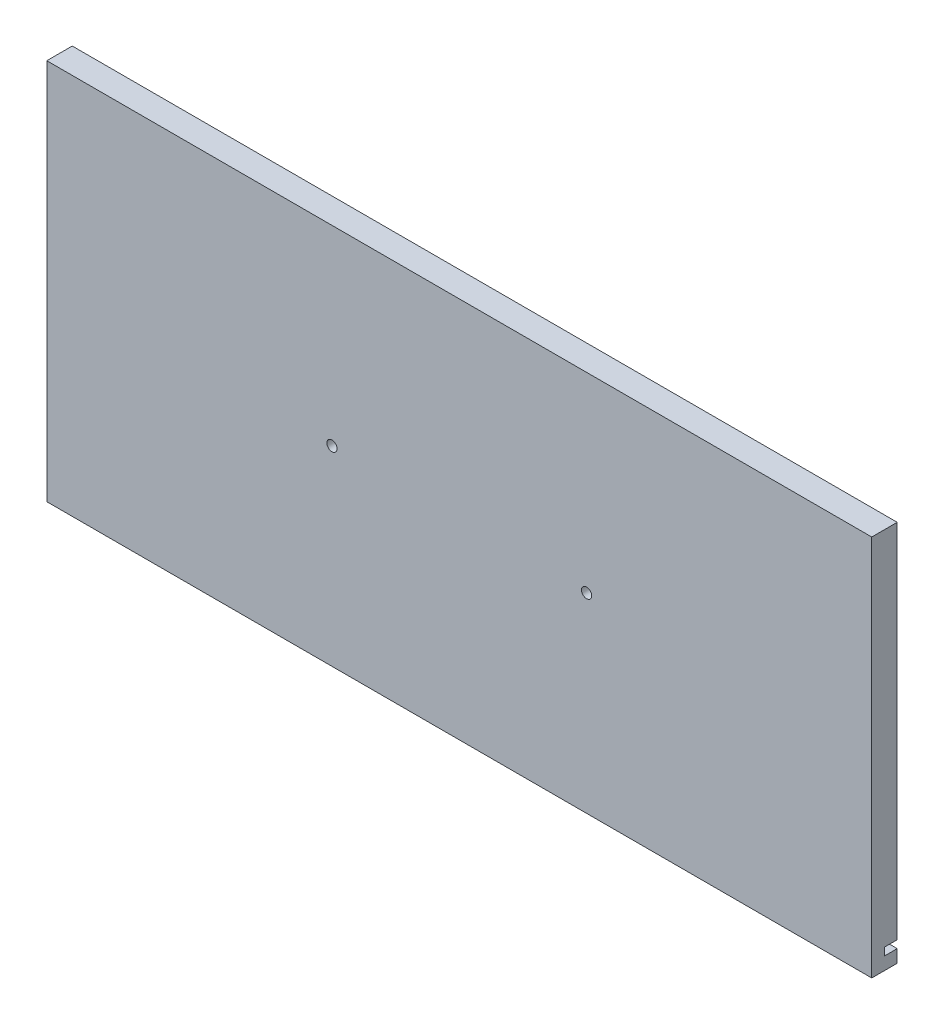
ISO-10303-21;
HEADER;
FILE_DESCRIPTION(('STEP AP214'),'2;1');
FILE_NAME('part.step','',(''),(''),'','','');
FILE_SCHEMA(('AUTOMOTIVE_DESIGN { 1 0 10303 214 1 1 1 1 }'));
ENDSEC;
DATA;
#1=APPLICATION_CONTEXT('core data for automotive mechanical design processes');
#2=APPLICATION_PROTOCOL_DEFINITION('international standard','automotive_design',2000,#1);
#3=PRODUCT_CONTEXT('',#1,'mechanical');
#4=PRODUCT('Part','Part','',(#3));
#5=PRODUCT_RELATED_PRODUCT_CATEGORY('part','',(#4));
#6=PRODUCT_DEFINITION_FORMATION('','',#4);
#7=PRODUCT_DEFINITION_CONTEXT('part definition',#1,'design');
#8=PRODUCT_DEFINITION('design','',#6,#7);
#9=PRODUCT_DEFINITION_SHAPE('','',#8);
#10=(LENGTH_UNIT() NAMED_UNIT(*) SI_UNIT(.MILLI.,.METRE.));
#11=(NAMED_UNIT(*) PLANE_ANGLE_UNIT() SI_UNIT($,.RADIAN.));
#12=(NAMED_UNIT(*) SI_UNIT($,.STERADIAN.) SOLID_ANGLE_UNIT());
#13=UNCERTAINTY_MEASURE_WITH_UNIT(LENGTH_MEASURE(1.E-05),#10,'distance_accuracy_value','');
#14=(GEOMETRIC_REPRESENTATION_CONTEXT(3) GLOBAL_UNCERTAINTY_ASSIGNED_CONTEXT((#13)) GLOBAL_UNIT_ASSIGNED_CONTEXT((#10,
#11,#12)) REPRESENTATION_CONTEXT('',''));
#15=CARTESIAN_POINT('',(0.,0.,0.));
#16=DIRECTION('',(0.,0.,1.));
#17=DIRECTION('',(1.,0.,0.));
#18=AXIS2_PLACEMENT_3D('',#15,#16,#17);
#19=CARTESIAN_POINT('',(162.,75.,0.));
#20=DIRECTION('',(0.,0.,-1.));
#21=DIRECTION('',(-1.,0.,0.));
#22=AXIS2_PLACEMENT_3D('',#19,#20,#21);
#23=PLANE('',#22);
#24=DIRECTION('',(-1.,0.,0.));
#25=VECTOR('',#24,1.);
#26=CARTESIAN_POINT('',(-162.,-70.,0.));
#27=LINE('',#26,#25);
#28=CARTESIAN_POINT('',(162.,-70.,0.));
#29=VERTEX_POINT('',#28);
#30=CARTESIAN_POINT('',(-162.,-70.,0.));
#31=VERTEX_POINT('',#30);
#32=EDGE_CURVE('E119',#29,#31,#27,.T.);
#33=ORIENTED_EDGE('',*,*,#32,.F.);
#34=DIRECTION('',(0.,1.,0.));
#35=VECTOR('',#34,1.);
#36=CARTESIAN_POINT('',(162.,-75.,0.));
#37=LINE('',#36,#35);
#38=CARTESIAN_POINT('',(162.,-75.,0.));
#39=VERTEX_POINT('',#38);
#40=EDGE_CURVE('E165',#39,#29,#37,.T.);
#41=ORIENTED_EDGE('',*,*,#40,.F.);
#42=DIRECTION('',(1.,0.,0.));
#43=VECTOR('',#42,1.);
#44=CARTESIAN_POINT('',(-162.,-75.,0.));
#45=LINE('',#44,#43);
#46=CARTESIAN_POINT('',(-162.,-75.,0.));
#47=VERTEX_POINT('',#46);
#48=EDGE_CURVE('E75',#47,#39,#45,.T.);
#49=ORIENTED_EDGE('',*,*,#48,.F.);
#50=DIRECTION('',(0.,-1.,0.));
#51=VECTOR('',#50,1.);
#52=CARTESIAN_POINT('',(-162.,-75.,0.));
#53=LINE('',#52,#51);
#54=EDGE_CURVE('E170',#31,#47,#53,.T.);
#55=ORIENTED_EDGE('',*,*,#54,.F.);
#56=EDGE_LOOP('',(#33,#41,#49,#55));
#57=FACE_BOUND('',#56,.T.);
#58=ADVANCED_FACE('F30',(#57),#23,.T.);
#59=CARTESIAN_POINT('',(162.,-75.,10.));
#60=DIRECTION('',(-1.,0.,0.));
#61=DIRECTION('',(0.,0.,1.));
#62=AXIS2_PLACEMENT_3D('',#59,#60,#61);
#63=PLANE('',#62);
#64=ORIENTED_EDGE('',*,*,#40,.T.);
#65=DIRECTION('',(0.,0.,-1.));
#66=VECTOR('',#65,1.);
#67=CARTESIAN_POINT('',(162.,-70.,5.));
#68=LINE('',#67,#66);
#69=CARTESIAN_POINT('',(162.,-70.,5.));
#70=VERTEX_POINT('',#69);
#71=EDGE_CURVE('E127',#70,#29,#68,.T.);
#72=ORIENTED_EDGE('',*,*,#71,.F.);
#73=DIRECTION('',(0.,-1.,0.));
#74=VECTOR('',#73,1.);
#75=CARTESIAN_POINT('',(162.,-67.,5.));
#76=LINE('',#75,#74);
#77=CARTESIAN_POINT('',(162.,-67.,5.));
#78=VERTEX_POINT('',#77);
#79=EDGE_CURVE('E109',#78,#70,#76,.T.);
#80=ORIENTED_EDGE('',*,*,#79,.F.);
#81=DIRECTION('',(0.,0.,-1.));
#82=VECTOR('',#81,1.);
#83=CARTESIAN_POINT('',(162.,-67.,5.));
#84=LINE('',#83,#82);
#85=CARTESIAN_POINT('',(162.,-67.,0.));
#86=VERTEX_POINT('',#85);
#87=EDGE_CURVE('E106',#78,#86,#84,.T.);
#88=ORIENTED_EDGE('',*,*,#87,.T.);
#89=CARTESIAN_POINT('',(162.,75.,0.));
#90=VERTEX_POINT('',#89);
#91=EDGE_CURVE('E155',#86,#90,#37,.T.);
#92=ORIENTED_EDGE('',*,*,#91,.T.);
#93=DIRECTION('',(0.,0.,-1.));
#94=VECTOR('',#93,1.);
#95=CARTESIAN_POINT('',(162.,75.,10.));
#96=LINE('',#95,#94);
#97=CARTESIAN_POINT('',(162.,75.,10.));
#98=VERTEX_POINT('',#97);
#99=EDGE_CURVE('E11',#98,#90,#96,.T.);
#100=ORIENTED_EDGE('',*,*,#99,.F.);
#101=DIRECTION('',(0.,1.,0.));
#102=VECTOR('',#101,1.);
#103=CARTESIAN_POINT('',(162.,-75.,10.));
#104=LINE('',#103,#102);
#105=CARTESIAN_POINT('',(162.,-75.,10.));
#106=VERTEX_POINT('',#105);
#107=EDGE_CURVE('E158',#106,#98,#104,.T.);
#108=ORIENTED_EDGE('',*,*,#107,.F.);
#109=DIRECTION('',(0.,0.,-1.));
#110=VECTOR('',#109,1.);
#111=CARTESIAN_POINT('',(162.,-75.,10.));
#112=LINE('',#111,#110);
#113=EDGE_CURVE('E164',#106,#39,#112,.T.);
#114=ORIENTED_EDGE('',*,*,#113,.T.);
#115=EDGE_LOOP('',(#64,#72,#80,#88,#92,#100,#108,#114));
#116=FACE_BOUND('',#115,.T.);
#117=ADVANCED_FACE('F32',(#116),#63,.F.);
#118=CARTESIAN_POINT('',(-162.,75.,10.));
#119=DIRECTION('',(0.,-1.,0.));
#120=DIRECTION('',(1.,0.,0.));
#121=AXIS2_PLACEMENT_3D('',#118,#119,#120);
#122=PLANE('',#121);
#123=DIRECTION('',(-1.,0.,0.));
#124=VECTOR('',#123,1.);
#125=CARTESIAN_POINT('',(-162.,75.,0.));
#126=LINE('',#125,#124);
#127=CARTESIAN_POINT('',(-162.,75.,0.));
#128=VERTEX_POINT('',#127);
#129=EDGE_CURVE('E168',#90,#128,#126,.T.);
#130=ORIENTED_EDGE('',*,*,#129,.T.);
#131=DIRECTION('',(0.,0.,-1.));
#132=VECTOR('',#131,1.);
#133=CARTESIAN_POINT('',(-162.,75.,10.));
#134=LINE('',#133,#132);
#135=CARTESIAN_POINT('',(-162.,75.,10.));
#136=VERTEX_POINT('',#135);
#137=EDGE_CURVE('E38',#136,#128,#134,.T.);
#138=ORIENTED_EDGE('',*,*,#137,.F.);
#139=DIRECTION('',(-1.,0.,0.));
#140=VECTOR('',#139,1.);
#141=CARTESIAN_POINT('',(-162.,75.,10.));
#142=LINE('',#141,#140);
#143=EDGE_CURVE('E82',#98,#136,#142,.T.);
#144=ORIENTED_EDGE('',*,*,#143,.F.);
#145=ORIENTED_EDGE('',*,*,#99,.T.);
#146=EDGE_LOOP('',(#130,#138,#144,#145));
#147=FACE_BOUND('',#146,.T.);
#148=ADVANCED_FACE('F211',(#147),#122,.F.);
#149=CARTESIAN_POINT('',(-162.,-75.,10.));
#150=DIRECTION('',(1.,0.,0.));
#151=DIRECTION('',(0.,0.,-1.));
#152=AXIS2_PLACEMENT_3D('',#149,#150,#151);
#153=PLANE('',#152);
#154=DIRECTION('',(0.,1.,0.));
#155=VECTOR('',#154,1.);
#156=CARTESIAN_POINT('',(-162.,-67.,5.));
#157=LINE('',#156,#155);
#158=CARTESIAN_POINT('',(-162.,-70.,5.));
#159=VERTEX_POINT('',#158);
#160=CARTESIAN_POINT('',(-162.,-67.,5.));
#161=VERTEX_POINT('',#160);
#162=EDGE_CURVE('E110',#159,#161,#157,.T.);
#163=ORIENTED_EDGE('',*,*,#162,.F.);
#164=DIRECTION('',(0.,0.,-1.));
#165=VECTOR('',#164,1.);
#166=CARTESIAN_POINT('',(-162.,-70.,5.));
#167=LINE('',#166,#165);
#168=EDGE_CURVE('E139',#159,#31,#167,.T.);
#169=ORIENTED_EDGE('',*,*,#168,.T.);
#170=ORIENTED_EDGE('',*,*,#54,.T.);
#171=DIRECTION('',(0.,0.,-1.));
#172=VECTOR('',#171,1.);
#173=CARTESIAN_POINT('',(-162.,-75.,10.));
#174=LINE('',#173,#172);
#175=CARTESIAN_POINT('',(-162.,-75.,10.));
#176=VERTEX_POINT('',#175);
#177=EDGE_CURVE('E174',#176,#47,#174,.T.);
#178=ORIENTED_EDGE('',*,*,#177,.F.);
#179=DIRECTION('',(0.,-1.,0.));
#180=VECTOR('',#179,1.);
#181=CARTESIAN_POINT('',(-162.,-75.,10.));
#182=LINE('',#181,#180);
#183=EDGE_CURVE('E161',#136,#176,#182,.T.);
#184=ORIENTED_EDGE('',*,*,#183,.F.);
#185=ORIENTED_EDGE('',*,*,#137,.T.);
#186=CARTESIAN_POINT('',(-162.,-67.,0.));
#187=VERTEX_POINT('',#186);
#188=EDGE_CURVE('E125',#128,#187,#53,.T.);
#189=ORIENTED_EDGE('',*,*,#188,.T.);
#190=DIRECTION('',(0.,0.,-1.));
#191=VECTOR('',#190,1.);
#192=CARTESIAN_POINT('',(-162.,-67.,5.));
#193=LINE('',#192,#191);
#194=EDGE_CURVE('E45',#161,#187,#193,.T.);
#195=ORIENTED_EDGE('',*,*,#194,.F.);
#196=EDGE_LOOP('',(#163,#169,#170,#178,#184,#185,#189,#195));
#197=FACE_BOUND('',#196,.T.);
#198=ADVANCED_FACE('F122',(#197),#153,.F.);
#199=CARTESIAN_POINT('',(-162.,-75.,10.));
#200=DIRECTION('',(0.,1.,0.));
#201=DIRECTION('',(0.,0.,1.));
#202=AXIS2_PLACEMENT_3D('',#199,#200,#201);
#203=PLANE('',#202);
#204=ORIENTED_EDGE('',*,*,#48,.T.);
#205=ORIENTED_EDGE('',*,*,#113,.F.);
#206=DIRECTION('',(1.,0.,0.));
#207=VECTOR('',#206,1.);
#208=CARTESIAN_POINT('',(-162.,-75.,10.));
#209=LINE('',#208,#207);
#210=EDGE_CURVE('E54',#176,#106,#209,.T.);
#211=ORIENTED_EDGE('',*,*,#210,.F.);
#212=ORIENTED_EDGE('',*,*,#177,.T.);
#213=EDGE_LOOP('',(#204,#205,#211,#212));
#214=FACE_BOUND('',#213,.T.);
#215=ADVANCED_FACE('F201',(#214),#203,.F.);
#216=CARTESIAN_POINT('',(162.,75.,10.));
#217=DIRECTION('',(0.,0.,-1.));
#218=DIRECTION('',(-1.,0.,0.));
#219=AXIS2_PLACEMENT_3D('',#216,#217,#218);
#220=PLANE('',#219);
#221=CARTESIAN_POINT('',(50.,0.,10.));
#222=DIRECTION('',(0.,0.,1.));
#223=DIRECTION('',(-1.,0.,0.));
#224=AXIS2_PLACEMENT_3D('',#221,#222,#223);
#225=CIRCLE('',#224,2.);
#226=CARTESIAN_POINT('',(48.,0.,10.));
#227=VERTEX_POINT('',#226);
#228=EDGE_CURVE('E284',#227,#227,#225,.T.);
#229=ORIENTED_EDGE('',*,*,#228,.F.);
#230=EDGE_LOOP('',(#229));
#231=FACE_BOUND('',#230,.T.);
#232=CARTESIAN_POINT('',(-50.,0.,10.));
#233=DIRECTION('',(0.,0.,1.));
#234=DIRECTION('',(1.,0.,0.));
#235=AXIS2_PLACEMENT_3D('',#232,#233,#234);
#236=CIRCLE('',#235,2.);
#237=CARTESIAN_POINT('',(-48.,0.,10.));
#238=VERTEX_POINT('',#237);
#239=EDGE_CURVE('E187',#238,#238,#236,.T.);
#240=ORIENTED_EDGE('',*,*,#239,.F.);
#241=EDGE_LOOP('',(#240));
#242=FACE_BOUND('',#241,.T.);
#243=ORIENTED_EDGE('',*,*,#107,.T.);
#244=ORIENTED_EDGE('',*,*,#143,.T.);
#245=ORIENTED_EDGE('',*,*,#183,.T.);
#246=ORIENTED_EDGE('',*,*,#210,.T.);
#247=EDGE_LOOP('',(#243,#244,#245,#246));
#248=FACE_BOUND('',#247,.T.);
#249=ADVANCED_FACE('F203',(#231,#242,#248),#220,.F.);
#250=DIRECTION('',(1.,0.,0.));
#251=VECTOR('',#250,1.);
#252=CARTESIAN_POINT('',(-162.,-67.,0.));
#253=LINE('',#252,#251);
#254=EDGE_CURVE('E182',#187,#86,#253,.T.);
#255=ORIENTED_EDGE('',*,*,#254,.F.);
#256=ORIENTED_EDGE('',*,*,#188,.F.);
#257=ORIENTED_EDGE('',*,*,#129,.F.);
#258=ORIENTED_EDGE('',*,*,#91,.F.);
#259=EDGE_LOOP('',(#255,#256,#257,#258));
#260=FACE_BOUND('',#259,.T.);
#261=CARTESIAN_POINT('',(130.5,-57.5,0.));
#262=DIRECTION('',(0.,0.,-1.));
#263=DIRECTION('',(1.,0.,0.));
#264=AXIS2_PLACEMENT_3D('',#261,#262,#263);
#265=CIRCLE('',#264,2.5);
#266=CARTESIAN_POINT('',(133.,-57.5,0.));
#267=VERTEX_POINT('',#266);
#268=EDGE_CURVE('E136',#267,#267,#265,.T.);
#269=ORIENTED_EDGE('',*,*,#268,.F.);
#270=EDGE_LOOP('',(#269));
#271=FACE_BOUND('',#270,.T.);
#272=CARTESIAN_POINT('',(-140.5,-57.5,0.));
#273=DIRECTION('',(0.,0.,-1.));
#274=DIRECTION('',(-1.,0.,0.));
#275=AXIS2_PLACEMENT_3D('',#272,#273,#274);
#276=CIRCLE('',#275,2.5);
#277=CARTESIAN_POINT('',(-143.,-57.5,0.));
#278=VERTEX_POINT('',#277);
#279=EDGE_CURVE('E135',#278,#278,#276,.T.);
#280=ORIENTED_EDGE('',*,*,#279,.F.);
#281=EDGE_LOOP('',(#280));
#282=FACE_BOUND('',#281,.T.);
#283=CARTESIAN_POINT('',(-140.5,17.5,0.));
#284=DIRECTION('',(0.,0.,-1.));
#285=DIRECTION('',(1.,0.,0.));
#286=AXIS2_PLACEMENT_3D('',#283,#284,#285);
#287=CIRCLE('',#286,2.5);
#288=CARTESIAN_POINT('',(-138.,17.5,0.));
#289=VERTEX_POINT('',#288);
#290=EDGE_CURVE('E143',#289,#289,#287,.T.);
#291=ORIENTED_EDGE('',*,*,#290,.F.);
#292=EDGE_LOOP('',(#291));
#293=FACE_BOUND('',#292,.T.);
#294=CARTESIAN_POINT('',(130.5,17.5,0.));
#295=DIRECTION('',(0.,0.,-1.));
#296=DIRECTION('',(-1.,0.,0.));
#297=AXIS2_PLACEMENT_3D('',#294,#295,#296);
#298=CIRCLE('',#297,2.5);
#299=CARTESIAN_POINT('',(128.,17.5,0.));
#300=VERTEX_POINT('',#299);
#301=EDGE_CURVE('E149',#300,#300,#298,.T.);
#302=ORIENTED_EDGE('',*,*,#301,.F.);
#303=EDGE_LOOP('',(#302));
#304=FACE_BOUND('',#303,.T.);
#305=ADVANCED_FACE('F179',(#260,#271,#282,#293,#304),#23,.T.);
#306=CARTESIAN_POINT('',(130.5,17.5,5.));
#307=DIRECTION('',(0.,0.,-1.));
#308=DIRECTION('',(-1.,0.,0.));
#309=AXIS2_PLACEMENT_3D('',#306,#307,#308);
#310=CYLINDRICAL_SURFACE('',#309,2.5);
#311=CARTESIAN_POINT('',(130.5,17.5,5.));
#312=DIRECTION('',(0.,0.,-1.));
#313=DIRECTION('',(-1.,0.,0.));
#314=AXIS2_PLACEMENT_3D('',#311,#312,#313);
#315=CIRCLE('',#314,2.5);
#316=CARTESIAN_POINT('',(128.,17.5,5.));
#317=VERTEX_POINT('',#316);
#318=EDGE_CURVE('E152',#317,#317,#315,.T.);
#319=ORIENTED_EDGE('',*,*,#318,.F.);
#320=EDGE_LOOP('',(#319));
#321=FACE_BOUND('',#320,.T.);
#322=ORIENTED_EDGE('',*,*,#301,.T.);
#323=EDGE_LOOP('',(#322));
#324=FACE_BOUND('',#323,.T.);
#325=ADVANCED_FACE('F219',(#321,#324),#310,.F.);
#326=CARTESIAN_POINT('',(130.5,17.5,5.));
#327=DIRECTION('',(0.,0.,-1.));
#328=DIRECTION('',(-1.,0.,0.));
#329=AXIS2_PLACEMENT_3D('',#326,#327,#328);
#330=PLANE('',#329);
#331=ORIENTED_EDGE('',*,*,#318,.T.);
#332=EDGE_LOOP('',(#331));
#333=FACE_BOUND('',#332,.T.);
#334=ADVANCED_FACE('F223',(#333),#330,.T.);
#335=CARTESIAN_POINT('',(-140.5,17.5,5.));
#336=DIRECTION('',(0.,0.,-1.));
#337=DIRECTION('',(-1.,0.,0.));
#338=AXIS2_PLACEMENT_3D('',#335,#336,#337);
#339=CYLINDRICAL_SURFACE('',#338,2.5);
#340=CARTESIAN_POINT('',(-140.5,17.5,5.));
#341=DIRECTION('',(0.,0.,-1.));
#342=DIRECTION('',(1.,0.,0.));
#343=AXIS2_PLACEMENT_3D('',#340,#341,#342);
#344=CIRCLE('',#343,2.5);
#345=CARTESIAN_POINT('',(-138.,17.5,5.));
#346=VERTEX_POINT('',#345);
#347=EDGE_CURVE('E146',#346,#346,#344,.T.);
#348=ORIENTED_EDGE('',*,*,#347,.F.);
#349=EDGE_LOOP('',(#348));
#350=FACE_BOUND('',#349,.T.);
#351=ORIENTED_EDGE('',*,*,#290,.T.);
#352=EDGE_LOOP('',(#351));
#353=FACE_BOUND('',#352,.T.);
#354=ADVANCED_FACE('F229',(#350,#353),#339,.F.);
#355=CARTESIAN_POINT('',(-140.5,17.5,5.));
#356=DIRECTION('',(0.,0.,1.));
#357=DIRECTION('',(1.,0.,0.));
#358=AXIS2_PLACEMENT_3D('',#355,#356,#357);
#359=PLANE('',#358);
#360=ORIENTED_EDGE('',*,*,#347,.T.);
#361=EDGE_LOOP('',(#360));
#362=FACE_BOUND('',#361,.T.);
#363=ADVANCED_FACE('F237',(#362),#359,.F.);
#364=CARTESIAN_POINT('',(-140.5,-57.5,5.));
#365=DIRECTION('',(0.,0.,-1.));
#366=DIRECTION('',(-1.,0.,0.));
#367=AXIS2_PLACEMENT_3D('',#364,#365,#366);
#368=CYLINDRICAL_SURFACE('',#367,2.5);
#369=CARTESIAN_POINT('',(-140.5,-57.5,5.));
#370=DIRECTION('',(0.,0.,-1.));
#371=DIRECTION('',(-1.,0.,0.));
#372=AXIS2_PLACEMENT_3D('',#369,#370,#371);
#373=CIRCLE('',#372,2.5);
#374=CARTESIAN_POINT('',(-143.,-57.5,5.));
#375=VERTEX_POINT('',#374);
#376=EDGE_CURVE('E140',#375,#375,#373,.T.);
#377=ORIENTED_EDGE('',*,*,#376,.F.);
#378=EDGE_LOOP('',(#377));
#379=FACE_BOUND('',#378,.T.);
#380=ORIENTED_EDGE('',*,*,#279,.T.);
#381=EDGE_LOOP('',(#380));
#382=FACE_BOUND('',#381,.T.);
#383=ADVANCED_FACE('F241',(#379,#382),#368,.F.);
#384=CARTESIAN_POINT('',(-140.5,-57.5,5.));
#385=DIRECTION('',(0.,0.,-1.));
#386=DIRECTION('',(-1.,0.,0.));
#387=AXIS2_PLACEMENT_3D('',#384,#385,#386);
#388=PLANE('',#387);
#389=ORIENTED_EDGE('',*,*,#376,.T.);
#390=EDGE_LOOP('',(#389));
#391=FACE_BOUND('',#390,.T.);
#392=ADVANCED_FACE('F245',(#391),#388,.T.);
#393=CARTESIAN_POINT('',(130.5,-57.5,5.));
#394=DIRECTION('',(0.,0.,-1.));
#395=DIRECTION('',(-1.,0.,0.));
#396=AXIS2_PLACEMENT_3D('',#393,#394,#395);
#397=CYLINDRICAL_SURFACE('',#396,2.5);
#398=CARTESIAN_POINT('',(130.5,-57.5,5.));
#399=DIRECTION('',(0.,0.,-1.));
#400=DIRECTION('',(1.,0.,0.));
#401=AXIS2_PLACEMENT_3D('',#398,#399,#400);
#402=CIRCLE('',#401,2.5);
#403=CARTESIAN_POINT('',(133.,-57.5,5.));
#404=VERTEX_POINT('',#403);
#405=EDGE_CURVE('E132',#404,#404,#402,.T.);
#406=ORIENTED_EDGE('',*,*,#405,.F.);
#407=EDGE_LOOP('',(#406));
#408=FACE_BOUND('',#407,.T.);
#409=ORIENTED_EDGE('',*,*,#268,.T.);
#410=EDGE_LOOP('',(#409));
#411=FACE_BOUND('',#410,.T.);
#412=ADVANCED_FACE('F249',(#408,#411),#397,.F.);
#413=CARTESIAN_POINT('',(130.5,-57.5,5.));
#414=DIRECTION('',(0.,0.,1.));
#415=DIRECTION('',(1.,0.,0.));
#416=AXIS2_PLACEMENT_3D('',#413,#414,#415);
#417=PLANE('',#416);
#418=ORIENTED_EDGE('',*,*,#405,.T.);
#419=EDGE_LOOP('',(#418));
#420=FACE_BOUND('',#419,.T.);
#421=ADVANCED_FACE('F253',(#420),#417,.F.);
#422=CARTESIAN_POINT('',(-162.,-70.,5.));
#423=DIRECTION('',(0.,-1.,0.));
#424=DIRECTION('',(1.,0.,0.));
#425=AXIS2_PLACEMENT_3D('',#422,#423,#424);
#426=PLANE('',#425);
#427=ORIENTED_EDGE('',*,*,#32,.T.);
#428=ORIENTED_EDGE('',*,*,#168,.F.);
#429=DIRECTION('',(-1.,0.,0.));
#430=VECTOR('',#429,1.);
#431=CARTESIAN_POINT('',(-162.,-70.,5.));
#432=LINE('',#431,#430);
#433=EDGE_CURVE('E116',#70,#159,#432,.T.);
#434=ORIENTED_EDGE('',*,*,#433,.F.);
#435=ORIENTED_EDGE('',*,*,#71,.T.);
#436=EDGE_LOOP('',(#427,#428,#434,#435));
#437=FACE_BOUND('',#436,.T.);
#438=ADVANCED_FACE('F194',(#437),#426,.F.);
#439=CARTESIAN_POINT('',(-162.,-67.,5.));
#440=DIRECTION('',(0.,1.,0.));
#441=DIRECTION('',(-1.,0.,0.));
#442=AXIS2_PLACEMENT_3D('',#439,#440,#441);
#443=PLANE('',#442);
#444=ORIENTED_EDGE('',*,*,#254,.T.);
#445=ORIENTED_EDGE('',*,*,#87,.F.);
#446=DIRECTION('',(1.,0.,0.));
#447=VECTOR('',#446,1.);
#448=CARTESIAN_POINT('',(-162.,-67.,5.));
#449=LINE('',#448,#447);
#450=EDGE_CURVE('E102',#161,#78,#449,.T.);
#451=ORIENTED_EDGE('',*,*,#450,.F.);
#452=ORIENTED_EDGE('',*,*,#194,.T.);
#453=EDGE_LOOP('',(#444,#445,#451,#452));
#454=FACE_BOUND('',#453,.T.);
#455=ADVANCED_FACE('F104',(#454),#443,.F.);
#456=CARTESIAN_POINT('',(-162.,-70.,5.));
#457=DIRECTION('',(0.,0.,1.));
#458=DIRECTION('',(1.,0.,0.));
#459=AXIS2_PLACEMENT_3D('',#456,#457,#458);
#460=PLANE('',#459);
#461=ORIENTED_EDGE('',*,*,#162,.T.);
#462=ORIENTED_EDGE('',*,*,#450,.T.);
#463=ORIENTED_EDGE('',*,*,#79,.T.);
#464=ORIENTED_EDGE('',*,*,#433,.T.);
#465=EDGE_LOOP('',(#461,#462,#463,#464));
#466=FACE_BOUND('',#465,.T.);
#467=ADVANCED_FACE('F114',(#466),#460,.F.);
#468=CARTESIAN_POINT('',(-50.,0.,4.));
#469=DIRECTION('',(0.,0.,1.));
#470=DIRECTION('',(1.,0.,0.));
#471=AXIS2_PLACEMENT_3D('',#468,#469,#470);
#472=CYLINDRICAL_SURFACE('',#471,2.);
#473=CARTESIAN_POINT('',(-50.,0.,4.));
#474=DIRECTION('',(0.,0.,1.));
#475=DIRECTION('',(1.,0.,0.));
#476=AXIS2_PLACEMENT_3D('',#473,#474,#475);
#477=CIRCLE('',#476,2.);
#478=CARTESIAN_POINT('',(-48.,0.,4.));
#479=VERTEX_POINT('',#478);
#480=EDGE_CURVE('E183',#479,#479,#477,.T.);
#481=ORIENTED_EDGE('',*,*,#480,.F.);
#482=EDGE_LOOP('',(#481));
#483=FACE_BOUND('',#482,.T.);
#484=ORIENTED_EDGE('',*,*,#239,.T.);
#485=EDGE_LOOP('',(#484));
#486=FACE_BOUND('',#485,.T.);
#487=ADVANCED_FACE('F264',(#483,#486),#472,.F.);
#488=CARTESIAN_POINT('',(-50.,0.,4.));
#489=DIRECTION('',(0.,0.,1.));
#490=DIRECTION('',(1.,0.,0.));
#491=AXIS2_PLACEMENT_3D('',#488,#489,#490);
#492=PLANE('',#491);
#493=ORIENTED_EDGE('',*,*,#480,.T.);
#494=EDGE_LOOP('',(#493));
#495=FACE_BOUND('',#494,.T.);
#496=ADVANCED_FACE('F267',(#495),#492,.T.);
#497=CARTESIAN_POINT('',(50.,0.,4.));
#498=DIRECTION('',(0.,0.,1.));
#499=DIRECTION('',(1.,0.,0.));
#500=AXIS2_PLACEMENT_3D('',#497,#498,#499);
#501=CYLINDRICAL_SURFACE('',#500,2.);
#502=CARTESIAN_POINT('',(50.,0.,4.));
#503=DIRECTION('',(0.,0.,1.));
#504=DIRECTION('',(-1.,0.,0.));
#505=AXIS2_PLACEMENT_3D('',#502,#503,#504);
#506=CIRCLE('',#505,2.);
#507=CARTESIAN_POINT('',(48.,0.,4.));
#508=VERTEX_POINT('',#507);
#509=EDGE_CURVE('E283',#508,#508,#506,.T.);
#510=ORIENTED_EDGE('',*,*,#509,.F.);
#511=EDGE_LOOP('',(#510));
#512=FACE_BOUND('',#511,.T.);
#513=ORIENTED_EDGE('',*,*,#228,.T.);
#514=EDGE_LOOP('',(#513));
#515=FACE_BOUND('',#514,.T.);
#516=ADVANCED_FACE('F271',(#512,#515),#501,.F.);
#517=CARTESIAN_POINT('',(50.,0.,4.));
#518=DIRECTION('',(0.,0.,-1.));
#519=DIRECTION('',(-1.,0.,0.));
#520=AXIS2_PLACEMENT_3D('',#517,#518,#519);
#521=PLANE('',#520);
#522=ORIENTED_EDGE('',*,*,#509,.T.);
#523=EDGE_LOOP('',(#522));
#524=FACE_BOUND('',#523,.T.);
#525=ADVANCED_FACE('F275',(#524),#521,.F.);
#526=CLOSED_SHELL('',(#58,#117,#148,#198,#215,#249,#305,#325,#334,#354,#363,#383,#392,#412,#421,
#438,#455,#467,#487,#496,#516,#525));
#527=MANIFOLD_SOLID_BREP('B2',#526);
#528=ADVANCED_BREP_SHAPE_REPRESENTATION('',(#18,#527),#14);
#529=SHAPE_DEFINITION_REPRESENTATION(#9,#528);
ENDSEC;
END-ISO-10303-21;
